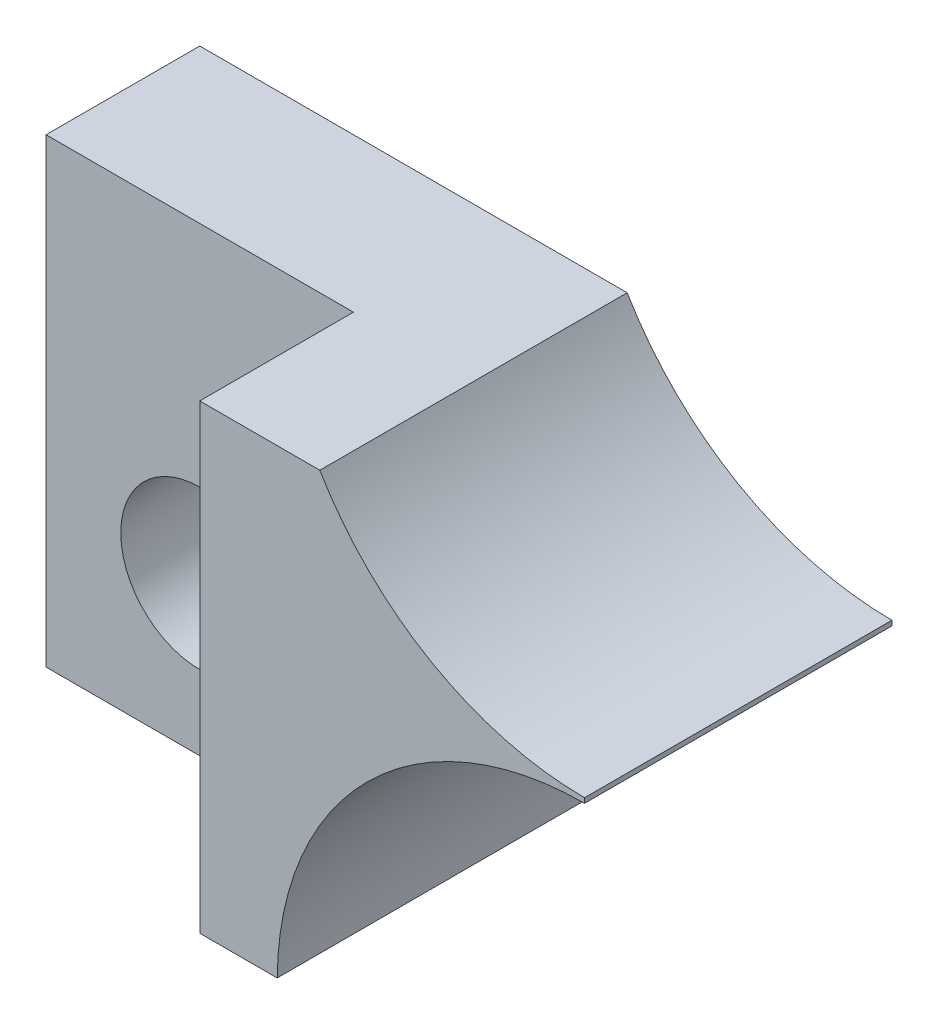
ISO-10303-21;
HEADER;
FILE_DESCRIPTION(('STEP AP214'),'2;1');
FILE_NAME('part.step','',(''),(''),'','','');
FILE_SCHEMA(('AUTOMOTIVE_DESIGN { 1 0 10303 214 1 1 1 1 }'));
ENDSEC;
DATA;
#1=APPLICATION_CONTEXT('core data for automotive mechanical design processes');
#2=APPLICATION_PROTOCOL_DEFINITION('international standard','automotive_design',2000,#1);
#3=PRODUCT_CONTEXT('',#1,'mechanical');
#4=PRODUCT('Part','Part','',(#3));
#5=PRODUCT_RELATED_PRODUCT_CATEGORY('part','',(#4));
#6=PRODUCT_DEFINITION_FORMATION('','',#4);
#7=PRODUCT_DEFINITION_CONTEXT('part definition',#1,'design');
#8=PRODUCT_DEFINITION('design','',#6,#7);
#9=PRODUCT_DEFINITION_SHAPE('','',#8);
#10=(LENGTH_UNIT() NAMED_UNIT(*) SI_UNIT(.MILLI.,.METRE.));
#11=(NAMED_UNIT(*) PLANE_ANGLE_UNIT() SI_UNIT($,.RADIAN.));
#12=(NAMED_UNIT(*) SI_UNIT($,.STERADIAN.) SOLID_ANGLE_UNIT());
#13=UNCERTAINTY_MEASURE_WITH_UNIT(LENGTH_MEASURE(1.E-05),#10,'distance_accuracy_value','');
#14=(GEOMETRIC_REPRESENTATION_CONTEXT(3) GLOBAL_UNCERTAINTY_ASSIGNED_CONTEXT((#13)) GLOBAL_UNIT_ASSIGNED_CONTEXT((#10,
#11,#12)) REPRESENTATION_CONTEXT('',''));
#15=CARTESIAN_POINT('',(0.,0.,0.));
#16=DIRECTION('',(0.,0.,1.));
#17=DIRECTION('',(1.,0.,0.));
#18=AXIS2_PLACEMENT_3D('',#15,#16,#17);
#19=CARTESIAN_POINT('',(14.3002,-0.0508000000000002,6.35));
#20=DIRECTION('',(0.,0.,-1.));
#21=DIRECTION('',(-1.,0.,0.));
#22=AXIS2_PLACEMENT_3D('',#19,#20,#21);
#23=CYLINDRICAL_SURFACE('',#22,6.35);
#24=DIRECTION('',(0.,0.,-1.));
#25=VECTOR('',#24,1.);
#26=CARTESIAN_POINT('',(14.3002,6.2992,6.35));
#27=LINE('',#26,#25);
#28=CARTESIAN_POINT('',(14.3002,6.2992,6.35));
#29=VERTEX_POINT('',#28);
#30=CARTESIAN_POINT('',(14.3002,6.2992,0.));
#31=VERTEX_POINT('',#30);
#32=EDGE_CURVE('E48',#29,#31,#27,.T.);
#33=ORIENTED_EDGE('',*,*,#32,.F.);
#34=CARTESIAN_POINT('',(14.3002,-0.0508000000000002,6.35));
#35=DIRECTION('',(0.,0.,-1.));
#36=DIRECTION('',(-1.,0.,0.));
#37=AXIS2_PLACEMENT_3D('',#34,#35,#36);
#38=CIRCLE('',#37,6.35);
#39=CARTESIAN_POINT('',(7.9504032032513,0.,6.35));
#40=VERTEX_POINT('',#39);
#41=EDGE_CURVE('E142',#40,#29,#38,.T.);
#42=ORIENTED_EDGE('',*,*,#41,.F.);
#43=DIRECTION('',(0.,0.,-1.));
#44=VECTOR('',#43,1.);
#45=CARTESIAN_POINT('',(7.9504032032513,0.,6.35));
#46=LINE('',#45,#44);
#47=CARTESIAN_POINT('',(7.9504032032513,0.,0.));
#48=VERTEX_POINT('',#47);
#49=EDGE_CURVE('E41',#40,#48,#46,.T.);
#50=ORIENTED_EDGE('',*,*,#49,.T.);
#51=CARTESIAN_POINT('',(14.3002,-0.0508000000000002,0.));
#52=DIRECTION('',(0.,0.,-1.));
#53=DIRECTION('',(-1.,0.,0.));
#54=AXIS2_PLACEMENT_3D('',#51,#52,#53);
#55=CIRCLE('',#54,6.35);
#56=EDGE_CURVE('E118',#48,#31,#55,.T.);
#57=ORIENTED_EDGE('',*,*,#56,.T.);
#58=EDGE_LOOP('',(#33,#42,#50,#57));
#59=FACE_BOUND('',#58,.T.);
#60=ADVANCED_FACE('F32',(#59),#23,.F.);
#61=CARTESIAN_POINT('',(14.3002,12.7508,6.35));
#62=DIRECTION('',(0.,0.,-1.));
#63=DIRECTION('',(-1.,0.,0.));
#64=AXIS2_PLACEMENT_3D('',#61,#62,#63);
#65=CYLINDRICAL_SURFACE('',#64,6.35);
#66=DIRECTION('',(0.,0.,-1.));
#67=VECTOR('',#66,1.);
#68=CARTESIAN_POINT('',(14.3002,6.4008,6.35));
#69=LINE('',#68,#67);
#70=CARTESIAN_POINT('',(14.3002,6.4008,0.));
#71=VERTEX_POINT('',#70);
#72=CARTESIAN_POINT('',(14.3002,6.4008,6.35));
#73=VERTEX_POINT('',#72);
#74=EDGE_CURVE('E97',#71,#73,#69,.F.);
#75=ORIENTED_EDGE('',*,*,#74,.F.);
#76=CARTESIAN_POINT('',(14.3002,12.7508,0.));
#77=DIRECTION('',(0.,0.,-1.));
#78=DIRECTION('',(-1.,0.,0.));
#79=AXIS2_PLACEMENT_3D('',#76,#77,#78);
#80=CIRCLE('',#79,6.35);
#81=CARTESIAN_POINT('',(8.83058261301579,9.52499999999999,0.));
#82=VERTEX_POINT('',#81);
#83=EDGE_CURVE('E109',#71,#82,#80,.T.);
#84=ORIENTED_EDGE('',*,*,#83,.T.);
#85=DIRECTION('',(0.,0.,-1.));
#86=VECTOR('',#85,1.);
#87=CARTESIAN_POINT('',(8.83058261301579,9.52499999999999,6.35));
#88=LINE('',#87,#86);
#89=CARTESIAN_POINT('',(8.83058261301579,9.52499999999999,6.35));
#90=VERTEX_POINT('',#89);
#91=EDGE_CURVE('E137',#90,#82,#88,.T.);
#92=ORIENTED_EDGE('',*,*,#91,.F.);
#93=CARTESIAN_POINT('',(14.3002,12.7508,6.35));
#94=DIRECTION('',(0.,0.,-1.));
#95=DIRECTION('',(-1.,0.,0.));
#96=AXIS2_PLACEMENT_3D('',#93,#94,#95);
#97=CIRCLE('',#96,6.35);
#98=EDGE_CURVE('E111',#73,#90,#97,.T.);
#99=ORIENTED_EDGE('',*,*,#98,.F.);
#100=EDGE_LOOP('',(#75,#84,#92,#99));
#101=FACE_BOUND('',#100,.T.);
#102=ADVANCED_FACE('F107',(#101),#65,.F.);
#103=CARTESIAN_POINT('',(-32.4430669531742,6.35000000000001,6.35));
#104=DIRECTION('',(0.,0.,-1.));
#105=DIRECTION('',(-1.,0.,0.));
#106=AXIS2_PLACEMENT_3D('',#103,#104,#105);
#107=PLANE('',#106);
#108=DIRECTION('',(0.,-1.,0.));
#109=VECTOR('',#108,1.);
#110=CARTESIAN_POINT('',(14.3002,6.35000000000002,6.35));
#111=LINE('',#110,#109);
#112=EDGE_CURVE('E103',#73,#29,#111,.T.);
#113=ORIENTED_EDGE('',*,*,#112,.F.);
#114=ORIENTED_EDGE('',*,*,#98,.T.);
#115=DIRECTION('',(-1.,0.,0.));
#116=VECTOR('',#115,1.);
#117=CARTESIAN_POINT('',(-32.4430669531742,9.525,6.35));
#118=LINE('',#117,#116);
#119=CARTESIAN_POINT('',(6.35,9.52499999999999,6.35));
#120=VERTEX_POINT('',#119);
#121=EDGE_CURVE('E135',#90,#120,#118,.T.);
#122=ORIENTED_EDGE('',*,*,#121,.T.);
#123=DIRECTION('',(0.,-1.,0.));
#124=VECTOR('',#123,1.);
#125=CARTESIAN_POINT('',(6.35,6.35000000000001,6.35));
#126=LINE('',#125,#124);
#127=CARTESIAN_POINT('',(6.35,0.,6.35));
#128=VERTEX_POINT('',#127);
#129=EDGE_CURVE('E11',#120,#128,#126,.T.);
#130=ORIENTED_EDGE('',*,*,#129,.T.);
#131=DIRECTION('',(-1.,0.,0.));
#132=VECTOR('',#131,1.);
#133=CARTESIAN_POINT('',(-32.4430669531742,0.,6.35));
#134=LINE('',#133,#132);
#135=EDGE_CURVE('E131',#40,#128,#134,.T.);
#136=ORIENTED_EDGE('',*,*,#135,.F.);
#137=ORIENTED_EDGE('',*,*,#41,.T.);
#138=EDGE_LOOP('',(#113,#114,#122,#130,#136,#137));
#139=FACE_BOUND('',#138,.T.);
#140=ADVANCED_FACE('F172',(#139),#107,.F.);
#141=CARTESIAN_POINT('',(-32.4430669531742,6.35000000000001,0.));
#142=DIRECTION('',(0.,0.,-1.));
#143=DIRECTION('',(-1.,0.,0.));
#144=AXIS2_PLACEMENT_3D('',#141,#142,#143);
#145=PLANE('',#144);
#146=CARTESIAN_POINT('',(3.175,3.175,0.));
#147=DIRECTION('',(0.,0.,-1.));
#148=DIRECTION('',(-1.,0.,0.));
#149=AXIS2_PLACEMENT_3D('',#146,#147,#148);
#150=CIRCLE('',#149,1.63195);
#151=CARTESIAN_POINT('',(1.54305,3.175,0.));
#152=VERTEX_POINT('',#151);
#153=EDGE_CURVE('E128',#152,#152,#150,.T.);
#154=ORIENTED_EDGE('',*,*,#153,.F.);
#155=EDGE_LOOP('',(#154));
#156=FACE_BOUND('',#155,.T.);
#157=ORIENTED_EDGE('',*,*,#83,.F.);
#158=DIRECTION('',(0.,-1.,0.));
#159=VECTOR('',#158,1.);
#160=CARTESIAN_POINT('',(14.3002,12.7508,0.));
#161=LINE('',#160,#159);
#162=EDGE_CURVE('E94',#71,#31,#161,.T.);
#163=ORIENTED_EDGE('',*,*,#162,.T.);
#164=ORIENTED_EDGE('',*,*,#56,.F.);
#165=DIRECTION('',(-1.,0.,0.));
#166=VECTOR('',#165,1.);
#167=CARTESIAN_POINT('',(-32.4430669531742,0.,0.));
#168=LINE('',#167,#166);
#169=CARTESIAN_POINT('',(0.,0.,0.));
#170=VERTEX_POINT('',#169);
#171=EDGE_CURVE('E122',#48,#170,#168,.T.);
#172=ORIENTED_EDGE('',*,*,#171,.T.);
#173=DIRECTION('',(0.,-1.,0.));
#174=VECTOR('',#173,1.);
#175=CARTESIAN_POINT('',(0.,6.35000000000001,0.));
#176=LINE('',#175,#174);
#177=CARTESIAN_POINT('',(0.,9.525,0.));
#178=VERTEX_POINT('',#177);
#179=EDGE_CURVE('E120',#178,#170,#176,.T.);
#180=ORIENTED_EDGE('',*,*,#179,.F.);
#181=DIRECTION('',(-1.,0.,0.));
#182=VECTOR('',#181,1.);
#183=CARTESIAN_POINT('',(-32.4430669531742,9.525,0.));
#184=LINE('',#183,#182);
#185=EDGE_CURVE('E117',#82,#178,#184,.T.);
#186=ORIENTED_EDGE('',*,*,#185,.F.);
#187=EDGE_LOOP('',(#157,#163,#164,#172,#180,#186));
#188=FACE_BOUND('',#187,.T.);
#189=ADVANCED_FACE('F114',(#156,#188),#145,.T.);
#190=CARTESIAN_POINT('',(-32.4430669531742,0.,6.35));
#191=DIRECTION('',(0.,-1.,0.));
#192=DIRECTION('',(0.,0.,-1.));
#193=AXIS2_PLACEMENT_3D('',#190,#191,#192);
#194=PLANE('',#193);
#195=DIRECTION('',(0.,0.,1.));
#196=VECTOR('',#195,1.);
#197=CARTESIAN_POINT('',(6.35,0.,6.35));
#198=LINE('',#197,#196);
#199=CARTESIAN_POINT('',(6.35,0.,3.175));
#200=VERTEX_POINT('',#199);
#201=EDGE_CURVE('E56',#200,#128,#198,.T.);
#202=ORIENTED_EDGE('',*,*,#201,.F.);
#203=DIRECTION('',(1.,0.,0.));
#204=VECTOR('',#203,1.);
#205=CARTESIAN_POINT('',(0.,0.,3.175));
#206=LINE('',#205,#204);
#207=CARTESIAN_POINT('',(0.,0.,3.175));
#208=VERTEX_POINT('',#207);
#209=EDGE_CURVE('E167',#208,#200,#206,.T.);
#210=ORIENTED_EDGE('',*,*,#209,.F.);
#211=DIRECTION('',(0.,0.,-1.));
#212=VECTOR('',#211,1.);
#213=CARTESIAN_POINT('',(0.,0.,6.35));
#214=LINE('',#213,#212);
#215=EDGE_CURVE('E132',#208,#170,#214,.T.);
#216=ORIENTED_EDGE('',*,*,#215,.T.);
#217=ORIENTED_EDGE('',*,*,#171,.F.);
#218=ORIENTED_EDGE('',*,*,#49,.F.);
#219=ORIENTED_EDGE('',*,*,#135,.T.);
#220=EDGE_LOOP('',(#202,#210,#216,#217,#218,#219));
#221=FACE_BOUND('',#220,.T.);
#222=ADVANCED_FACE('F34',(#221),#194,.T.);
#223=CARTESIAN_POINT('',(-32.4430669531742,9.525,6.35));
#224=DIRECTION('',(0.,-1.,0.));
#225=DIRECTION('',(0.,0.,-1.));
#226=AXIS2_PLACEMENT_3D('',#223,#224,#225);
#227=PLANE('',#226);
#228=DIRECTION('',(1.,0.,0.));
#229=VECTOR('',#228,1.);
#230=CARTESIAN_POINT('',(-32.4430669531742,9.525,3.175));
#231=LINE('',#230,#229);
#232=CARTESIAN_POINT('',(0.,9.525,3.175));
#233=VERTEX_POINT('',#232);
#234=CARTESIAN_POINT('',(6.35,9.525,3.175));
#235=VERTEX_POINT('',#234);
#236=EDGE_CURVE('E150',#233,#235,#231,.T.);
#237=ORIENTED_EDGE('',*,*,#236,.T.);
#238=DIRECTION('',(0.,0.,1.));
#239=VECTOR('',#238,1.);
#240=CARTESIAN_POINT('',(6.35,9.525,6.35000000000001));
#241=LINE('',#240,#239);
#242=EDGE_CURVE('E159',#235,#120,#241,.T.);
#243=ORIENTED_EDGE('',*,*,#242,.T.);
#244=ORIENTED_EDGE('',*,*,#121,.F.);
#245=ORIENTED_EDGE('',*,*,#91,.T.);
#246=ORIENTED_EDGE('',*,*,#185,.T.);
#247=DIRECTION('',(0.,0.,-1.));
#248=VECTOR('',#247,1.);
#249=CARTESIAN_POINT('',(0.,9.525,6.35));
#250=LINE('',#249,#248);
#251=EDGE_CURVE('E134',#233,#178,#250,.T.);
#252=ORIENTED_EDGE('',*,*,#251,.F.);
#253=EDGE_LOOP('',(#237,#243,#244,#245,#246,#252));
#254=FACE_BOUND('',#253,.T.);
#255=ADVANCED_FACE('F180',(#254),#227,.F.);
#256=CARTESIAN_POINT('',(0.,6.35000000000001,6.35));
#257=DIRECTION('',(1.,0.,0.));
#258=DIRECTION('',(0.,0.,-1.));
#259=AXIS2_PLACEMENT_3D('',#256,#257,#258);
#260=PLANE('',#259);
#261=ORIENTED_EDGE('',*,*,#215,.F.);
#262=DIRECTION('',(0.,-1.,0.));
#263=VECTOR('',#262,1.);
#264=CARTESIAN_POINT('',(0.,12.7,3.175));
#265=LINE('',#264,#263);
#266=EDGE_CURVE('E163',#233,#208,#265,.T.);
#267=ORIENTED_EDGE('',*,*,#266,.F.);
#268=ORIENTED_EDGE('',*,*,#251,.T.);
#269=ORIENTED_EDGE('',*,*,#179,.T.);
#270=EDGE_LOOP('',(#261,#267,#268,#269));
#271=FACE_BOUND('',#270,.T.);
#272=ADVANCED_FACE('F177',(#271),#260,.F.);
#273=CARTESIAN_POINT('',(3.175,3.175,6.35));
#274=DIRECTION('',(0.,0.,-1.));
#275=DIRECTION('',(-1.,0.,0.));
#276=AXIS2_PLACEMENT_3D('',#273,#274,#275);
#277=CYLINDRICAL_SURFACE('',#276,1.63195);
#278=CARTESIAN_POINT('',(3.175,3.175,3.175));
#279=DIRECTION('',(0.,0.,-1.));
#280=DIRECTION('',(-1.,0.,0.));
#281=AXIS2_PLACEMENT_3D('',#278,#279,#280);
#282=CIRCLE('',#281,1.63195);
#283=CARTESIAN_POINT('',(1.54305,3.175,3.175));
#284=VERTEX_POINT('',#283);
#285=EDGE_CURVE('E36',#284,#284,#282,.F.);
#286=ORIENTED_EDGE('',*,*,#285,.T.);
#287=EDGE_LOOP('',(#286));
#288=FACE_BOUND('',#287,.T.);
#289=ORIENTED_EDGE('',*,*,#153,.T.);
#290=EDGE_LOOP('',(#289));
#291=FACE_BOUND('',#290,.T.);
#292=ADVANCED_FACE('F185',(#288,#291),#277,.F.);
#293=CARTESIAN_POINT('',(0.,12.7,3.175));
#294=DIRECTION('',(0.,0.,-1.));
#295=DIRECTION('',(-1.,0.,0.));
#296=AXIS2_PLACEMENT_3D('',#293,#294,#295);
#297=PLANE('',#296);
#298=ORIENTED_EDGE('',*,*,#285,.F.);
#299=EDGE_LOOP('',(#298));
#300=FACE_BOUND('',#299,.T.);
#301=ORIENTED_EDGE('',*,*,#266,.T.);
#302=ORIENTED_EDGE('',*,*,#209,.T.);
#303=DIRECTION('',(0.,-1.,0.));
#304=VECTOR('',#303,1.);
#305=CARTESIAN_POINT('',(6.35,12.7,3.175));
#306=LINE('',#305,#304);
#307=EDGE_CURVE('E162',#235,#200,#306,.T.);
#308=ORIENTED_EDGE('',*,*,#307,.F.);
#309=ORIENTED_EDGE('',*,*,#236,.F.);
#310=EDGE_LOOP('',(#301,#302,#308,#309));
#311=FACE_BOUND('',#310,.T.);
#312=ADVANCED_FACE('F183',(#300,#311),#297,.F.);
#313=CARTESIAN_POINT('',(6.35,12.7,6.35));
#314=DIRECTION('',(1.,0.,0.));
#315=DIRECTION('',(0.,0.,-1.));
#316=AXIS2_PLACEMENT_3D('',#313,#314,#315);
#317=PLANE('',#316);
#318=ORIENTED_EDGE('',*,*,#307,.T.);
#319=ORIENTED_EDGE('',*,*,#201,.T.);
#320=ORIENTED_EDGE('',*,*,#129,.F.);
#321=ORIENTED_EDGE('',*,*,#242,.F.);
#322=EDGE_LOOP('',(#318,#319,#320,#321));
#323=FACE_BOUND('',#322,.T.);
#324=ADVANCED_FACE('F182',(#323),#317,.F.);
#325=CARTESIAN_POINT('',(14.3002,12.7508,16.35));
#326=DIRECTION('',(1.,0.,0.));
#327=DIRECTION('',(0.,1.,0.));
#328=AXIS2_PLACEMENT_3D('',#325,#326,#327);
#329=PLANE('',#328);
#330=ORIENTED_EDGE('',*,*,#32,.T.);
#331=ORIENTED_EDGE('',*,*,#162,.F.);
#332=ORIENTED_EDGE('',*,*,#74,.T.);
#333=ORIENTED_EDGE('',*,*,#112,.T.);
#334=EDGE_LOOP('',(#330,#331,#332,#333));
#335=FACE_BOUND('',#334,.T.);
#336=ADVANCED_FACE('F96',(#335),#329,.T.);
#337=CLOSED_SHELL('',(#60,#102,#140,#189,#222,#255,#272,#292,#312,#324,#336));
#338=MANIFOLD_SOLID_BREP('B2',#337);
#339=ADVANCED_BREP_SHAPE_REPRESENTATION('',(#18,#338),#14);
#340=SHAPE_DEFINITION_REPRESENTATION(#9,#339);
ENDSEC;
END-ISO-10303-21;
